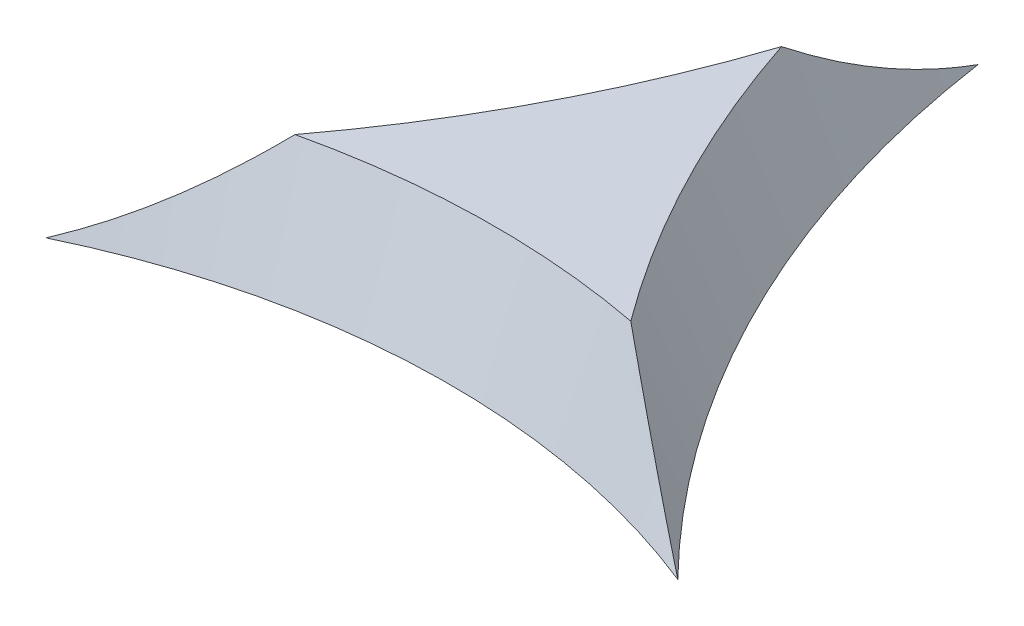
ISO-10303-21;
HEADER;
FILE_DESCRIPTION(('STEP AP214'),'2;1');
FILE_NAME('part.step','',(''),(''),'','','');
FILE_SCHEMA(('AUTOMOTIVE_DESIGN { 1 0 10303 214 1 1 1 1 }'));
ENDSEC;
DATA;
#1=APPLICATION_CONTEXT('core data for automotive mechanical design processes');
#2=APPLICATION_PROTOCOL_DEFINITION('international standard','automotive_design',2000,#1);
#3=PRODUCT_CONTEXT('',#1,'mechanical');
#4=PRODUCT('Part','Part','',(#3));
#5=PRODUCT_RELATED_PRODUCT_CATEGORY('part','',(#4));
#6=PRODUCT_DEFINITION_FORMATION('','',#4);
#7=PRODUCT_DEFINITION_CONTEXT('part definition',#1,'design');
#8=PRODUCT_DEFINITION('design','',#6,#7);
#9=PRODUCT_DEFINITION_SHAPE('','',#8);
#10=(LENGTH_UNIT() NAMED_UNIT(*) SI_UNIT(.MILLI.,.METRE.));
#11=(NAMED_UNIT(*) PLANE_ANGLE_UNIT() SI_UNIT($,.RADIAN.));
#12=(NAMED_UNIT(*) SI_UNIT($,.STERADIAN.) SOLID_ANGLE_UNIT());
#13=UNCERTAINTY_MEASURE_WITH_UNIT(LENGTH_MEASURE(1.E-05),#10,'distance_accuracy_value','');
#14=(GEOMETRIC_REPRESENTATION_CONTEXT(3) GLOBAL_UNCERTAINTY_ASSIGNED_CONTEXT((#13)) GLOBAL_UNIT_ASSIGNED_CONTEXT((#10,
#11,#12)) REPRESENTATION_CONTEXT('',''));
#15=CARTESIAN_POINT('',(0.,0.,0.));
#16=DIRECTION('',(0.,0.,1.));
#17=DIRECTION('',(1.,0.,0.));
#18=AXIS2_PLACEMENT_3D('',#15,#16,#17);
#19=CARTESIAN_POINT('',(39.063641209,12.9,6.626124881));
#20=DIRECTION('',(0.,-1.,0.));
#21=DIRECTION('',(0.,0.,-1.));
#22=AXIS2_PLACEMENT_3D('',#19,#20,#21);
#23=PLANE('',#22);
#24=CARTESIAN_POINT('',(40.5,12.9,12.8));
#25=DIRECTION('',(0.,1.,0.));
#26=DIRECTION('',(0.,0.,1.));
#27=AXIS2_PLACEMENT_3D('',#24,#25,#26);
#28=CIRCLE('',#27,6.35);
#29=CARTESIAN_POINT('',(41.6837427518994,12.9,6.56130998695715));
#30=VERTEX_POINT('',#29);
#31=CARTESIAN_POINT('',(39.0792680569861,12.9,6.61097578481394));
#32=VERTEX_POINT('',#31);
#33=EDGE_CURVE('E26',#30,#32,#28,.T.);
#34=ORIENTED_EDGE('',*,*,#33,.F.);
#35=CARTESIAN_POINT('',(48.8,12.9,1.3));
#36=DIRECTION('',(0.,1.,0.));
#37=DIRECTION('',(0.,0.,1.));
#38=AXIS2_PLACEMENT_3D('',#35,#36,#37);
#39=CIRCLE('',#38,8.85);
#40=CARTESIAN_POINT('',(40.4000000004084,12.9,4.08612634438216));
#41=VERTEX_POINT('',#40);
#42=EDGE_CURVE('E11',#41,#30,#39,.T.);
#43=ORIENTED_EDGE('',*,*,#42,.F.);
#44=CARTESIAN_POINT('',(32.,12.9,1.3));
#45=DIRECTION('',(0.,1.,0.));
#46=DIRECTION('',(0.,0.,1.));
#47=AXIS2_PLACEMENT_3D('',#44,#45,#46);
#48=CIRCLE('',#47,8.85);
#49=EDGE_CURVE('E69',#32,#41,#48,.T.);
#50=ORIENTED_EDGE('',*,*,#49,.F.);
#51=EDGE_LOOP('',(#34,#43,#50));
#52=FACE_BOUND('',#51,.T.);
#53=ADVANCED_FACE('F16',(#52),#23,.F.);
#54=CARTESIAN_POINT('',(48.8,12.,1.3));
#55=DIRECTION('',(0.,1.,0.));
#56=DIRECTION('',(0.,0.,1.));
#57=AXIS2_PLACEMENT_3D('',#54,#55,#56);
#58=CONICAL_SURFACE('',#57,8.49,0.380506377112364);
#59=CARTESIAN_POINT('',(42.7375090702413,12.0000000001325,7.24359350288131));
#60=CARTESIAN_POINT('',(42.6938215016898,12.0268994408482,7.21440232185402));
#61=CARTESIAN_POINT('',(42.6505540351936,12.0549038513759,7.18561633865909));
#62=CARTESIAN_POINT('',(42.5638817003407,12.1135906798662,7.12818293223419));
#63=CARTESIAN_POINT('',(42.5204962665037,12.1443196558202,7.09955369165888));
#64=CARTESIAN_POINT('',(42.4335569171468,12.2084521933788,7.04240363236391));
#65=CARTESIAN_POINT('',(42.3900248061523,12.2419027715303,7.0139025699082));
#66=CARTESIAN_POINT('',(42.3027564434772,12.3114789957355,6.95697982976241));
#67=CARTESIAN_POINT('',(42.2590438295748,12.3476513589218,6.92857911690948));
#68=CARTESIAN_POINT('',(42.1713802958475,12.4226714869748,6.87183149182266));
#69=CARTESIAN_POINT('',(42.1274544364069,12.461564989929,6.84350645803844));
#70=CARTESIAN_POINT('',(42.0393302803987,12.542028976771,6.78688732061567));
#71=CARTESIAN_POINT('',(41.99515802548,12.5836437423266,6.75861572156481));
#72=CARTESIAN_POINT('',(41.9065075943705,12.6695505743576,6.70208313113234));
#73=CARTESIAN_POINT('',(41.8620560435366,12.7138850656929,6.67384501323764));
#74=CARTESIAN_POINT('',(41.7728140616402,12.8052383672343,6.61736228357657));
#75=CARTESIAN_POINT('',(41.7280504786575,12.8522976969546,6.58914071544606));
#76=CARTESIAN_POINT('',(41.6837427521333,12.899999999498,6.56130998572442));
#77=B_SPLINE_CURVE_WITH_KNOTS('',3,(#59,#60,#61,#62,#63,#64,#65,#66,#67,#68,#69,#70,#71,#72,#73,
#74,#75,#76),.UNSPECIFIED.,.F.,.F.,(4,2,2,2,2,2,2,2,4),(0.,0.177059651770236,0.358163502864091,
0.543694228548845,0.734005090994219,0.929420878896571,1.13023920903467,1.33673207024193,
1.54914750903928),.UNSPECIFIED.);
#78=CARTESIAN_POINT('',(42.7375090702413,12.0000000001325,7.24359350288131));
#79=VERTEX_POINT('',#78);
#80=EDGE_CURVE('E60',#79,#30,#77,.T.);
#81=ORIENTED_EDGE('',*,*,#80,.F.);
#82=CARTESIAN_POINT('',(48.8,12.,1.3));
#83=DIRECTION('',(0.,1.,0.));
#84=DIRECTION('',(0.,0.,1.));
#85=AXIS2_PLACEMENT_3D('',#82,#83,#84);
#86=CIRCLE('',#85,8.49);
#87=CARTESIAN_POINT('',(40.4,12.0000000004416,2.53292335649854));
#88=VERTEX_POINT('',#87);
#89=EDGE_CURVE('E64',#88,#79,#86,.T.);
#90=ORIENTED_EDGE('',*,*,#89,.F.);
#91=CARTESIAN_POINT('',(40.3999999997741,12.9000000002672,4.08612634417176));
#92=CARTESIAN_POINT('',(40.3999998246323,12.849159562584,4.02152298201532));
#93=CARTESIAN_POINT('',(40.399993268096,12.7992809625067,3.95615039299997));
#94=CARTESIAN_POINT('',(40.3999749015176,12.7031125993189,3.8256577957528));
#95=CARTESIAN_POINT('',(40.3999632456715,12.6567611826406,3.76058316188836));
#96=CARTESIAN_POINT('',(40.3999416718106,12.5676423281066,3.63063395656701));
#97=CARTESIAN_POINT('',(40.3999317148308,12.5248113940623,3.56580306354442));
#98=CARTESIAN_POINT('',(40.3999177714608,12.4427372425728,3.43629016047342));
#99=CARTESIAN_POINT('',(40.3999136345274,12.4034291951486,3.37164931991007));
#100=CARTESIAN_POINT('',(40.3999130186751,12.3284013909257,3.2424640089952));
#101=CARTESIAN_POINT('',(40.3999163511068,12.2926165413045,3.17795743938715));
#102=CARTESIAN_POINT('',(40.3999294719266,12.2246351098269,3.04898849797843));
#103=CARTESIAN_POINT('',(40.3999391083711,12.1923744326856,2.98455998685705));
#104=CARTESIAN_POINT('',(40.3999610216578,12.1314402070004,2.85569193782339));
#105=CARTESIAN_POINT('',(40.3999732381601,12.1027050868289,2.79128161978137));
#106=CARTESIAN_POINT('',(40.3999923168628,12.0488178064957,2.66240356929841));
#107=CARTESIAN_POINT('',(40.3999992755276,12.0236083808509,2.59795974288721));
#108=CARTESIAN_POINT('',(40.4,12.0000000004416,2.53292335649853));
#109=B_SPLINE_CURVE_WITH_KNOTS('',3,(#91,#92,#93,#94,#95,#96,#97,#98,#99,#100,#101,#102,#103,
#104,#105,#106,#107,#108),.UNSPECIFIED.,.F.,.F.,(4,2,2,2,2,2,2,2,4),(0.,0.246632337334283,
0.486273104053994,0.719326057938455,0.946232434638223,1.16747270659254,1.38356776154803,
1.59507928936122,1.8026091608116),.UNSPECIFIED.);
#110=EDGE_CURVE('E79',#41,#88,#109,.T.);
#111=ORIENTED_EDGE('',*,*,#110,.F.);
#112=ORIENTED_EDGE('',*,*,#42,.T.);
#113=EDGE_LOOP('',(#81,#90,#111,#112));
#114=FACE_BOUND('',#113,.T.);
#115=ADVANCED_FACE('F63',(#114),#58,.F.);
#116=CARTESIAN_POINT('',(40.5,12.,12.8));
#117=DIRECTION('',(0.,1.,0.));
#118=DIRECTION('',(0.,0.,1.));
#119=AXIS2_PLACEMENT_3D('',#116,#117,#118);
#120=CONICAL_SURFACE('',#119,5.99,0.380506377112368);
#121=CARTESIAN_POINT('',(37.9025314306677,12.0000000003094,7.40247676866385));
#122=CARTESIAN_POINT('',(37.9512108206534,12.0236466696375,7.36855178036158));
#123=CARTESIAN_POINT('',(37.9994372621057,12.0488562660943,7.33509093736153));
#124=CARTESIAN_POINT('',(38.0960495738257,12.1027371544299,7.26834697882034));
#125=CARTESIAN_POINT('',(38.1444135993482,12.1314747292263,7.23508565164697));
#126=CARTESIAN_POINT('',(38.2413498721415,12.192406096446,7.1687123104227));
#127=CARTESIAN_POINT('',(38.289895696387,12.2246695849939,7.13562596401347));
#128=CARTESIAN_POINT('',(38.3872491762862,12.2926503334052,7.06956655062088));
#129=CARTESIAN_POINT('',(38.4360265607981,12.3284386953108,7.03662222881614));
#130=CARTESIAN_POINT('',(38.5338916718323,12.4034682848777,6.97081211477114));
#131=CARTESIAN_POINT('',(38.5829458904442,12.4427803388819,6.93797747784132));
#132=CARTESIAN_POINT('',(38.6814107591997,12.524858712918,6.87235108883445));
#133=CARTESIAN_POINT('',(38.7307854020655,12.5676943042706,6.83959215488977));
#134=CARTESIAN_POINT('',(38.8299337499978,12.6568195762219,6.77408141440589));
#135=CARTESIAN_POINT('',(38.8796696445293,12.70317592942,6.74136339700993));
#136=CARTESIAN_POINT('',(38.9795810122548,12.7993541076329,6.67589860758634));
#137=CARTESIAN_POINT('',(39.0297175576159,12.8492397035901,6.6431859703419));
#138=CARTESIAN_POINT('',(39.0792680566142,12.9000000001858,6.61097578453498));
#139=B_SPLINE_CURVE_WITH_KNOTS('',3,(#121,#122,#123,#124,#125,#126,#127,#128,#129,#130,#131,
#132,#133,#134,#135,#136,#137,#138),.UNSPECIFIED.,.F.,.F.,(4,2,2,2,2,2,2,2,4),(0.,
0.191577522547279,0.387561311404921,0.588567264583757,0.795163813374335,1.00787219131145,
1.22716783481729,1.45348259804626,1.68720749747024),.UNSPECIFIED.);
#140=CARTESIAN_POINT('',(37.9025314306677,12.0000000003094,7.40247676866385));
#141=VERTEX_POINT('',#140);
#142=EDGE_CURVE('E83',#141,#32,#139,.T.);
#143=ORIENTED_EDGE('',*,*,#142,.F.);
#144=CARTESIAN_POINT('',(40.5,12.,12.8));
#145=DIRECTION('',(0.,1.,0.));
#146=DIRECTION('',(0.,0.,1.));
#147=AXIS2_PLACEMENT_3D('',#144,#145,#146);
#148=CIRCLE('',#147,5.99);
#149=EDGE_CURVE('E75',#79,#141,#148,.T.);
#150=ORIENTED_EDGE('',*,*,#149,.F.);
#151=ORIENTED_EDGE('',*,*,#80,.T.);
#152=ORIENTED_EDGE('',*,*,#33,.T.);
#153=EDGE_LOOP('',(#143,#150,#151,#152));
#154=FACE_BOUND('',#153,.T.);
#155=ADVANCED_FACE('F81',(#154),#120,.F.);
#156=CARTESIAN_POINT('',(32.,12.,1.3));
#157=DIRECTION('',(0.,1.,0.));
#158=DIRECTION('',(0.,0.,1.));
#159=AXIS2_PLACEMENT_3D('',#156,#157,#158);
#160=CONICAL_SURFACE('',#159,8.49,0.380506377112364);
#161=ORIENTED_EDGE('',*,*,#110,.T.);
#162=CARTESIAN_POINT('',(32.,12.,1.3));
#163=DIRECTION('',(0.,1.,0.));
#164=DIRECTION('',(0.,0.,1.));
#165=AXIS2_PLACEMENT_3D('',#162,#163,#164);
#166=CIRCLE('',#165,8.49);
#167=EDGE_CURVE('E77',#141,#88,#166,.T.);
#168=ORIENTED_EDGE('',*,*,#167,.F.);
#169=ORIENTED_EDGE('',*,*,#142,.T.);
#170=ORIENTED_EDGE('',*,*,#49,.T.);
#171=EDGE_LOOP('',(#161,#168,#169,#170));
#172=FACE_BOUND('',#171,.T.);
#173=ADVANCED_FACE('F108',(#172),#160,.F.);
#174=CARTESIAN_POINT('',(37.873521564,12.,7.43169409));
#175=DIRECTION('',(0.,-1.,0.));
#176=DIRECTION('',(0.,0.,-1.));
#177=AXIS2_PLACEMENT_3D('',#174,#175,#176);
#178=PLANE('',#177);
#179=ORIENTED_EDGE('',*,*,#149,.T.);
#180=ORIENTED_EDGE('',*,*,#167,.T.);
#181=ORIENTED_EDGE('',*,*,#89,.T.);
#182=EDGE_LOOP('',(#179,#180,#181));
#183=FACE_BOUND('',#182,.T.);
#184=ADVANCED_FACE('F74',(#183),#178,.T.);
#185=CLOSED_SHELL('',(#53,#115,#155,#173,#184));
#186=MANIFOLD_SOLID_BREP('B1',#185);
#187=ADVANCED_BREP_SHAPE_REPRESENTATION('',(#18,#186),#14);
#188=SHAPE_DEFINITION_REPRESENTATION(#9,#187);
ENDSEC;
END-ISO-10303-21;
